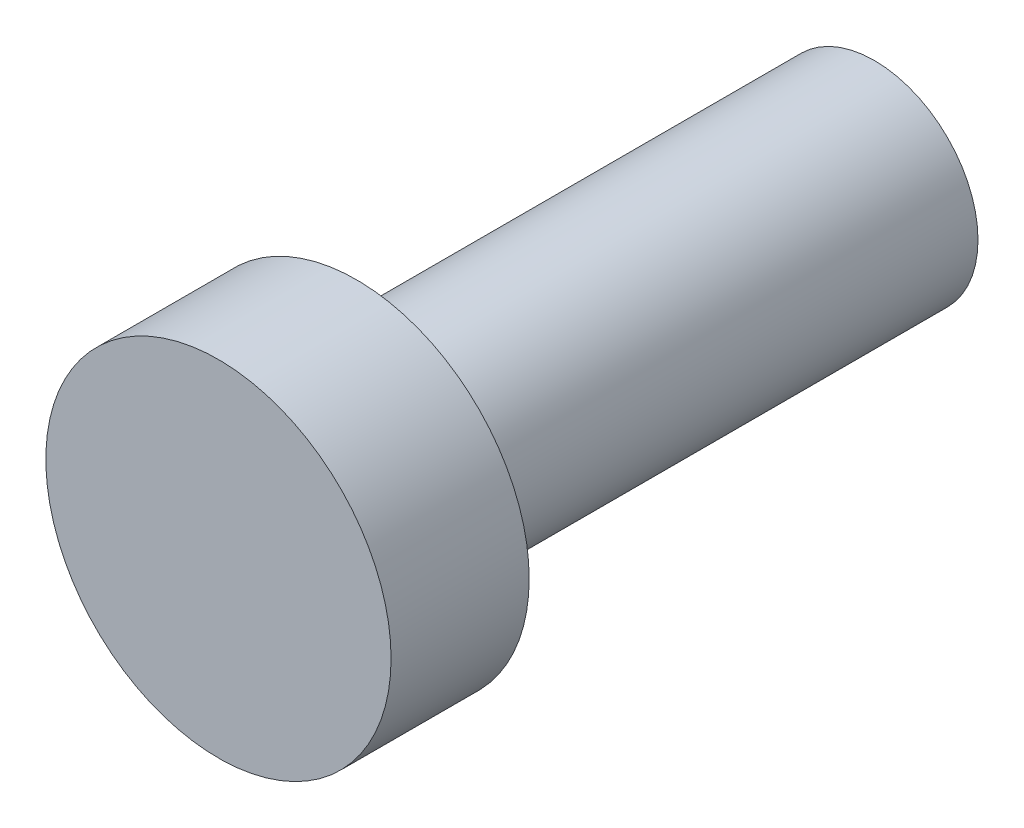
from build123d import *

# Parameters (mm, degrees)
SKETCH_1_R      = 5
EXTRUDE_1_DEPTH = 4
SKETCH_2_R      = 3
EXTRUDE_2_DEPTH = 15


with BuildPart() as part:
    # Sketch 1 → Extrude 1 (new body)
    with BuildSketch(Plane.XY):
        Circle(SKETCH_1_R)
    extrude(amount=EXTRUDE_1_DEPTH)

    # Sketch 2 → Extrude 2 (add)
    with BuildSketch(Plane.XY):
        Circle(SKETCH_2_R)
    extrude(amount=-EXTRUDE_2_DEPTH)


solid = part.part
